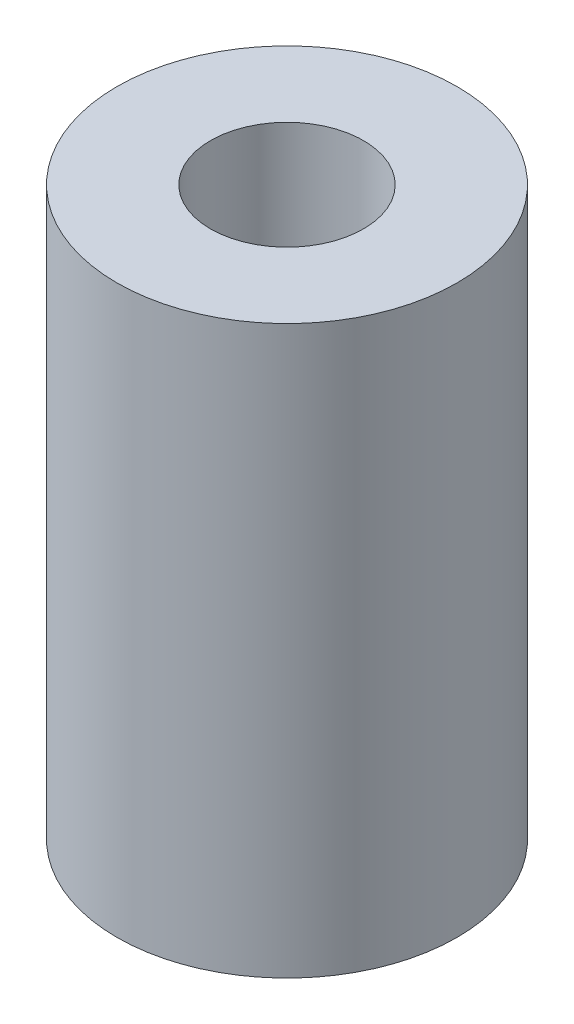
from build123d import *

# Parameters (mm, degrees)
SKETCH1_R      = 3
SKETCH1_R_2    = 1.35
EXTRUDE1_DEPTH = 10


with BuildPart() as part:
    # Sketch1 → Extrude1 (new body)
    with BuildSketch(Plane(origin=(0, 0, 0), x_dir=(1, 0, 0), z_dir=(0, 1, 0))):
        with Locations(Location((0, 0, 0), (0, 0, 270))):
            Circle(SKETCH1_R)
        with Locations(Location((0, 0, 0), (0, 0, 270))):
            Circle(SKETCH1_R_2, mode=Mode.SUBTRACT)
    extrude(amount=EXTRUDE1_DEPTH)


solid = part.part
